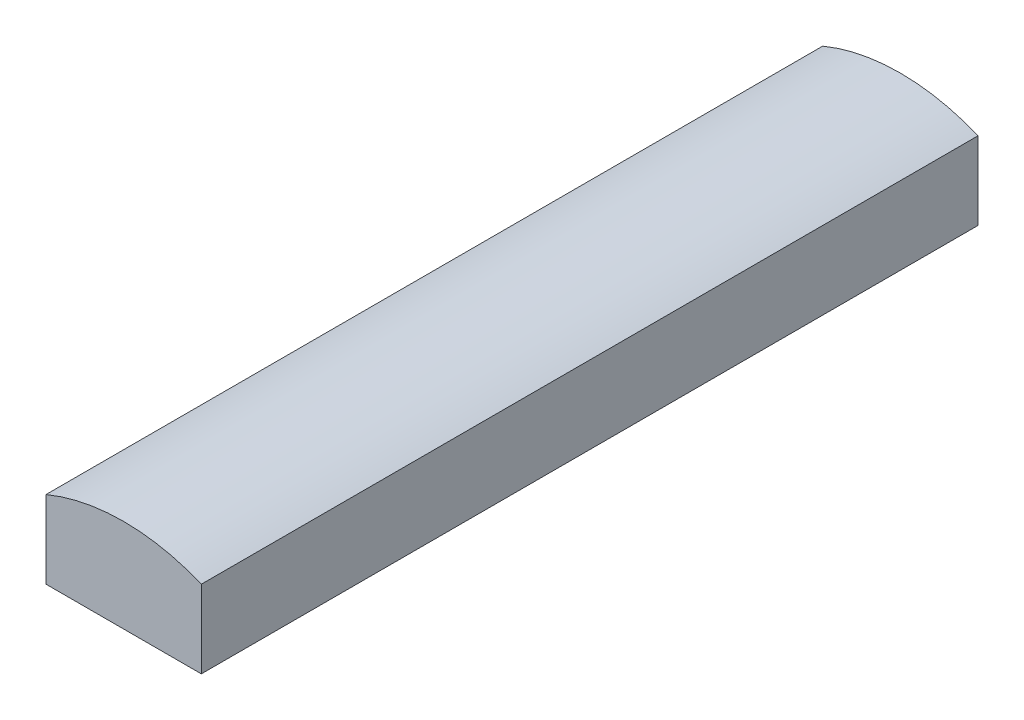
ISO-10303-21;
HEADER;
FILE_DESCRIPTION(('STEP AP214'),'2;1');
FILE_NAME('part.step','',(''),(''),'','','');
FILE_SCHEMA(('AUTOMOTIVE_DESIGN { 1 0 10303 214 1 1 1 1 }'));
ENDSEC;
DATA;
#1=APPLICATION_CONTEXT('core data for automotive mechanical design processes');
#2=APPLICATION_PROTOCOL_DEFINITION('international standard','automotive_design',2000,#1);
#3=PRODUCT_CONTEXT('',#1,'mechanical');
#4=PRODUCT('Part','Part','',(#3));
#5=PRODUCT_RELATED_PRODUCT_CATEGORY('part','',(#4));
#6=PRODUCT_DEFINITION_FORMATION('','',#4);
#7=PRODUCT_DEFINITION_CONTEXT('part definition',#1,'design');
#8=PRODUCT_DEFINITION('design','',#6,#7);
#9=PRODUCT_DEFINITION_SHAPE('','',#8);
#10=(LENGTH_UNIT() NAMED_UNIT(*) SI_UNIT(.MILLI.,.METRE.));
#11=(NAMED_UNIT(*) PLANE_ANGLE_UNIT() SI_UNIT($,.RADIAN.));
#12=(NAMED_UNIT(*) SI_UNIT($,.STERADIAN.) SOLID_ANGLE_UNIT());
#13=UNCERTAINTY_MEASURE_WITH_UNIT(LENGTH_MEASURE(1.E-05),#10,'distance_accuracy_value','');
#14=(GEOMETRIC_REPRESENTATION_CONTEXT(3) GLOBAL_UNCERTAINTY_ASSIGNED_CONTEXT((#13)) GLOBAL_UNIT_ASSIGNED_CONTEXT((#10,
#11,#12)) REPRESENTATION_CONTEXT('',''));
#15=CARTESIAN_POINT('',(0.,0.,0.));
#16=DIRECTION('',(0.,0.,1.));
#17=DIRECTION('',(1.,0.,0.));
#18=AXIS2_PLACEMENT_3D('',#15,#16,#17);
#19=CARTESIAN_POINT('',(-49.9999999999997,0.,-500.1));
#20=DIRECTION('',(0.,-1.,0.));
#21=DIRECTION('',(0.,0.,-1.));
#22=AXIS2_PLACEMENT_3D('',#19,#20,#21);
#23=PLANE('',#22);
#24=CARTESIAN_POINT('',(-9.70860900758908,0.,-27.3838067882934));
#25=DIRECTION('',(0.,-1.,0.));
#26=DIRECTION('',(0.,0.,-1.));
#27=AXIS2_PLACEMENT_3D('',#24,#25,#26);
#28=CIRCLE('',#27,0.050000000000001);
#29=CARTESIAN_POINT('',(-9.70860900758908,0.,-27.4338067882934));
#30=VERTEX_POINT('',#29);
#31=EDGE_CURVE('E77',#30,#30,#28,.T.);
#32=ORIENTED_EDGE('',*,*,#31,.F.);
#33=EDGE_LOOP('',(#32));
#34=FACE_BOUND('',#33,.T.);
#35=DIRECTION('',(0.,0.,1.));
#36=VECTOR('',#35,1.);
#37=CARTESIAN_POINT('',(-49.9999999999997,0.,-500.1));
#38=LINE('',#37,#36);
#39=CARTESIAN_POINT('',(-49.9999999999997,0.,-500.));
#40=VERTEX_POINT('',#39);
#41=CARTESIAN_POINT('',(-49.9999999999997,0.,0.));
#42=VERTEX_POINT('',#41);
#43=EDGE_CURVE('E11',#40,#42,#38,.T.);
#44=ORIENTED_EDGE('',*,*,#43,.F.);
#45=DIRECTION('',(1.,0.,0.));
#46=VECTOR('',#45,1.);
#47=CARTESIAN_POINT('',(50.0000000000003,0.,-500.));
#48=LINE('',#47,#46);
#49=CARTESIAN_POINT('',(50.0000000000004,0.,-500.));
#50=VERTEX_POINT('',#49);
#51=EDGE_CURVE('E71',#40,#50,#48,.T.);
#52=ORIENTED_EDGE('',*,*,#51,.T.);
#53=DIRECTION('',(0.,0.,1.));
#54=VECTOR('',#53,1.);
#55=CARTESIAN_POINT('',(50.0000000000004,0.,-500.1));
#56=LINE('',#55,#54);
#57=CARTESIAN_POINT('',(50.0000000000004,0.,0.));
#58=VERTEX_POINT('',#57);
#59=EDGE_CURVE('E34',#50,#58,#56,.T.);
#60=ORIENTED_EDGE('',*,*,#59,.T.);
#61=DIRECTION('',(1.,0.,0.));
#62=VECTOR('',#61,1.);
#63=CARTESIAN_POINT('',(-49.9999999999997,0.,0.));
#64=LINE('',#63,#62);
#65=EDGE_CURVE('E83',#42,#58,#64,.T.);
#66=ORIENTED_EDGE('',*,*,#65,.F.);
#67=EDGE_LOOP('',(#44,#52,#60,#66));
#68=FACE_BOUND('',#67,.T.);
#69=ADVANCED_FACE('F31',(#34,#68),#23,.T.);
#70=CARTESIAN_POINT('',(-49.9999999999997,50.,-500.1));
#71=DIRECTION('',(-1.,0.,0.));
#72=DIRECTION('',(0.,0.,1.));
#73=AXIS2_PLACEMENT_3D('',#70,#71,#72);
#74=PLANE('',#73);
#75=DIRECTION('',(0.,0.,1.));
#76=VECTOR('',#75,1.);
#77=CARTESIAN_POINT('',(-49.9999999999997,50.,-500.1));
#78=LINE('',#77,#76);
#79=CARTESIAN_POINT('',(-49.9999999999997,50.,-500.));
#80=VERTEX_POINT('',#79);
#81=CARTESIAN_POINT('',(-49.9999999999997,50.,0.));
#82=VERTEX_POINT('',#81);
#83=EDGE_CURVE('E39',#80,#82,#78,.T.);
#84=ORIENTED_EDGE('',*,*,#83,.F.);
#85=DIRECTION('',(0.,-1.,0.));
#86=VECTOR('',#85,1.);
#87=CARTESIAN_POINT('',(-49.9999999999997,0.,-500.));
#88=LINE('',#87,#86);
#89=EDGE_CURVE('E73',#80,#40,#88,.T.);
#90=ORIENTED_EDGE('',*,*,#89,.T.);
#91=ORIENTED_EDGE('',*,*,#43,.T.);
#92=DIRECTION('',(0.,-1.,0.));
#93=VECTOR('',#92,1.);
#94=CARTESIAN_POINT('',(-49.9999999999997,50.,0.));
#95=LINE('',#94,#93);
#96=EDGE_CURVE('E92',#82,#42,#95,.T.);
#97=ORIENTED_EDGE('',*,*,#96,.F.);
#98=EDGE_LOOP('',(#84,#90,#91,#97));
#99=FACE_BOUND('',#98,.T.);
#100=ADVANCED_FACE('F80',(#99),#74,.T.);
#101=CARTESIAN_POINT('',(3.12250225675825E-13,-70.0000000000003,-500.1));
#102=DIRECTION('',(0.,0.,1.));
#103=DIRECTION('',(1.,0.,0.));
#104=AXIS2_PLACEMENT_3D('',#101,#102,#103);
#105=CYLINDRICAL_SURFACE('',#104,130.);
#106=DIRECTION('',(0.,0.,1.));
#107=VECTOR('',#106,1.);
#108=CARTESIAN_POINT('',(50.0000000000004,50.,-500.1));
#109=LINE('',#108,#107);
#110=CARTESIAN_POINT('',(50.0000000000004,50.,-500.));
#111=VERTEX_POINT('',#110);
#112=CARTESIAN_POINT('',(50.0000000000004,50.,0.));
#113=VERTEX_POINT('',#112);
#114=EDGE_CURVE('E97',#111,#113,#109,.T.);
#115=ORIENTED_EDGE('',*,*,#114,.F.);
#116=CARTESIAN_POINT('',(3.12250225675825E-13,-70.0000000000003,-500.));
#117=DIRECTION('',(0.,0.,-1.));
#118=DIRECTION('',(-1.,0.,0.));
#119=AXIS2_PLACEMENT_3D('',#116,#117,#118);
#120=CIRCLE('',#119,130.);
#121=EDGE_CURVE('E47',#111,#80,#120,.F.);
#122=ORIENTED_EDGE('',*,*,#121,.T.);
#123=ORIENTED_EDGE('',*,*,#83,.T.);
#124=CARTESIAN_POINT('',(3.12250225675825E-13,-70.0000000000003,0.));
#125=DIRECTION('',(0.,0.,1.));
#126=DIRECTION('',(-1.,0.,0.));
#127=AXIS2_PLACEMENT_3D('',#124,#125,#126);
#128=CIRCLE('',#127,130.);
#129=EDGE_CURVE('E95',#113,#82,#128,.T.);
#130=ORIENTED_EDGE('',*,*,#129,.F.);
#131=EDGE_LOOP('',(#115,#122,#123,#130));
#132=FACE_BOUND('',#131,.T.);
#133=ADVANCED_FACE('F105',(#132),#105,.T.);
#134=CARTESIAN_POINT('',(50.0000000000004,0.,-500.1));
#135=DIRECTION('',(1.,0.,0.));
#136=DIRECTION('',(0.,0.,-1.));
#137=AXIS2_PLACEMENT_3D('',#134,#135,#136);
#138=PLANE('',#137);
#139=ORIENTED_EDGE('',*,*,#59,.F.);
#140=DIRECTION('',(0.,1.,0.));
#141=VECTOR('',#140,1.);
#142=CARTESIAN_POINT('',(50.0000000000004,50.,-500.));
#143=LINE('',#142,#141);
#144=EDGE_CURVE('E74',#50,#111,#143,.T.);
#145=ORIENTED_EDGE('',*,*,#144,.T.);
#146=ORIENTED_EDGE('',*,*,#114,.T.);
#147=DIRECTION('',(0.,1.,0.));
#148=VECTOR('',#147,1.);
#149=CARTESIAN_POINT('',(50.0000000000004,0.,0.));
#150=LINE('',#149,#148);
#151=EDGE_CURVE('E88',#58,#113,#150,.T.);
#152=ORIENTED_EDGE('',*,*,#151,.F.);
#153=EDGE_LOOP('',(#139,#145,#146,#152));
#154=FACE_BOUND('',#153,.T.);
#155=ADVANCED_FACE('F103',(#154),#138,.T.);
#156=CARTESIAN_POINT('',(3.12250225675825E-13,-70.0000000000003,0.));
#157=DIRECTION('',(0.,0.,-1.));
#158=DIRECTION('',(-1.,0.,0.));
#159=AXIS2_PLACEMENT_3D('',#156,#157,#158);
#160=PLANE('',#159);
#161=ORIENTED_EDGE('',*,*,#65,.T.);
#162=ORIENTED_EDGE('',*,*,#151,.T.);
#163=ORIENTED_EDGE('',*,*,#129,.T.);
#164=ORIENTED_EDGE('',*,*,#96,.T.);
#165=EDGE_LOOP('',(#161,#162,#163,#164));
#166=FACE_BOUND('',#165,.T.);
#167=ADVANCED_FACE('F93',(#166),#160,.F.);
#168=CARTESIAN_POINT('',(-9.70860900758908,-0.1,-27.3838067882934));
#169=DIRECTION('',(0.,1.,0.));
#170=DIRECTION('',(0.,0.,1.));
#171=AXIS2_PLACEMENT_3D('',#168,#169,#170);
#172=CYLINDRICAL_SURFACE('',#171,0.050000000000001);
#173=CARTESIAN_POINT('',(-9.70860900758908,-0.1,-27.3838067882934));
#174=DIRECTION('',(0.,-1.,0.));
#175=DIRECTION('',(0.,0.,-1.));
#176=AXIS2_PLACEMENT_3D('',#173,#174,#175);
#177=CIRCLE('',#176,0.050000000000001);
#178=CARTESIAN_POINT('',(-9.70860900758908,-0.1,-27.4338067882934));
#179=VERTEX_POINT('',#178);
#180=EDGE_CURVE('E89',#179,#179,#177,.T.);
#181=ORIENTED_EDGE('',*,*,#180,.F.);
#182=EDGE_LOOP('',(#181));
#183=FACE_BOUND('',#182,.T.);
#184=ORIENTED_EDGE('',*,*,#31,.T.);
#185=EDGE_LOOP('',(#184));
#186=FACE_BOUND('',#185,.T.);
#187=ADVANCED_FACE('F114',(#183,#186),#172,.T.);
#188=CARTESIAN_POINT('',(-9.70860900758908,-0.1,-27.3838067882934));
#189=DIRECTION('',(0.,-1.,0.));
#190=DIRECTION('',(0.,0.,-1.));
#191=AXIS2_PLACEMENT_3D('',#188,#189,#190);
#192=PLANE('',#191);
#193=ORIENTED_EDGE('',*,*,#180,.T.);
#194=EDGE_LOOP('',(#193));
#195=FACE_BOUND('',#194,.T.);
#196=ADVANCED_FACE('F134',(#195),#192,.T.);
#197=CARTESIAN_POINT('',(49.9999999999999,0.,-500.));
#198=DIRECTION('',(0.,0.,-1.));
#199=DIRECTION('',(-1.,0.,0.));
#200=AXIS2_PLACEMENT_3D('',#197,#198,#199);
#201=PLANE('',#200);
#202=ORIENTED_EDGE('',*,*,#144,.F.);
#203=ORIENTED_EDGE('',*,*,#51,.F.);
#204=ORIENTED_EDGE('',*,*,#89,.F.);
#205=ORIENTED_EDGE('',*,*,#121,.F.);
#206=EDGE_LOOP('',(#202,#203,#204,#205));
#207=FACE_BOUND('',#206,.T.);
#208=ADVANCED_FACE('F72',(#207),#201,.T.);
#209=CLOSED_SHELL('',(#69,#100,#133,#155,#167,#187,#196,#208));
#210=MANIFOLD_SOLID_BREP('B2',#209);
#211=ADVANCED_BREP_SHAPE_REPRESENTATION('',(#18,#210),#14);
#212=SHAPE_DEFINITION_REPRESENTATION(#9,#211);
ENDSEC;
END-ISO-10303-21;
